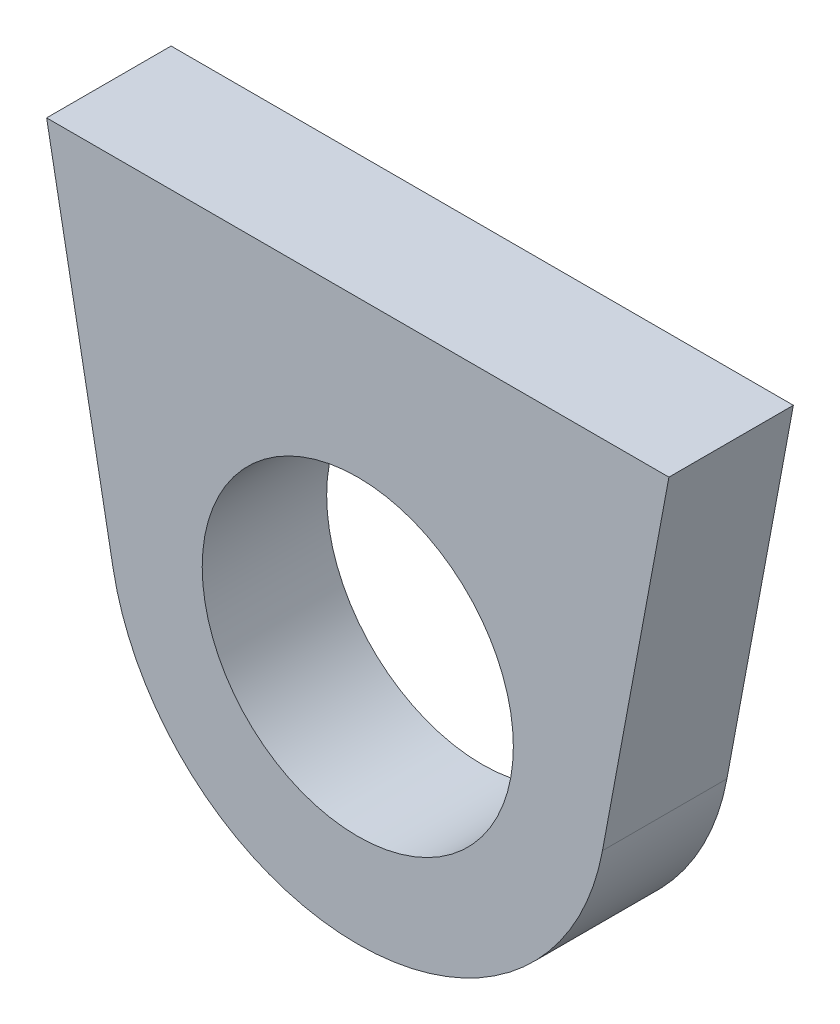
from build123d import *

# Parameters (mm, degrees)
CROQUIS1_R              = 50
SALIENTE_EXTRUIR1_DEPTH = 40


with BuildPart() as part:
    # Croquis1 → Saliente-Extruir1 (new body)
    with BuildSketch(Plane.XY):
        with BuildLine():
            Line((-78.647615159, -14.647615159), (-100, 100))
            Line((-100, 100), (100, 100))
            Line((100, 100), (78.647615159, -14.647615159))
            ThreePointArc((78.647615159, -14.647615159), (0, -80), (-78.647615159, -14.647615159))
        make_face()
        Circle(CROQUIS1_R, mode=Mode.SUBTRACT)
    extrude(amount=SALIENTE_EXTRUIR1_DEPTH)


solid = part.part
